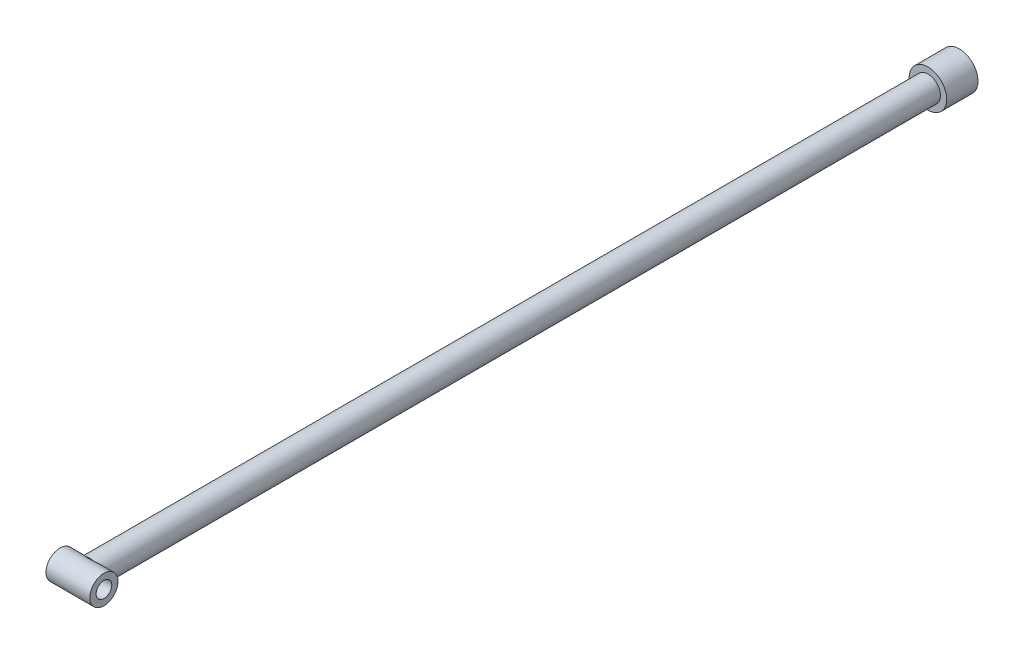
from build123d import *

# Parameters (mm, degrees)
ESQUISSE1_R                  = 29.9
BASE_EXTRUSION_DEPTH         = 50
ESQUISSE2_R                  = 20
BOSS_EXTRU_1_DEPTH           = 1338
ESQUISSE3_R                  = 22.5
ESQUISSE3_R_2                = 12.5
BOSS_EXTRU_2_DEPTH           = 35
ENL_V_MAT_EXTRU_1_REACH      = 1425.245
ENL_V_MAT_EXTRU_1_END_RADIUS = 22.5
ESQUISSE4_R                  = 2.75


with BuildPart() as part:
    # Esquisse1 → Base-Extrusion (new body)
    with BuildSketch(Plane.XY):
        Circle(ESQUISSE1_R)
    extrude(amount=BASE_EXTRUSION_DEPTH)

    # Esquisse2 → Boss.-Extru.1 (add)
    with BuildSketch(Plane.XY.offset(50)):
        Circle(ESQUISSE2_R)
    extrude(amount=BOSS_EXTRU_1_DEPTH)

    # Esquisse3 → Boss.-Extru.2 (add, symmetric)
    with BuildSketch(Plane(origin=(0, 0, 0), x_dir=(0, 0, -1), z_dir=(1, 0, 0))):
        with Locations((-1400, 0)):
            Circle(ESQUISSE3_R)
        with Locations((-1400, 0)):
            Circle(ESQUISSE3_R_2, mode=Mode.SUBTRACT)
    extrude(amount=BOSS_EXTRU_2_DEPTH, both=True)

    # Enl_v. mat.-Extru.1: up to this cylinder (the profile starts inside it)
    enl_v_mat_extru_1_end = Plane(origin=(0, 0, 1400), z_dir=(-1, 0, 0)) * Cylinder(ENL_V_MAT_EXTRU_1_END_RADIUS, 2896.49, mode=Mode.PRIVATE)
    # Esquisse4 → Enl_v. mat.-Extru.1 (cut, up to the surface)
    with BuildSketch(Plane(origin=(0, 0, 0), x_dir=(1, 0, 0), z_dir=(0, 1, 0)), mode=Mode.PRIVATE) as enl_v_mat_extru_1_sk1:
        with Locations(Location((0, -1400, 0), (0, 0, 270))):
            Circle(ESQUISSE4_R)
    enl_v_mat_extru_1_tool1 = extrude(enl_v_mat_extru_1_sk1.sketch, amount=-ENL_V_MAT_EXTRU_1_REACH, mode=Mode.PRIVATE) & enl_v_mat_extru_1_end
    add(enl_v_mat_extru_1_tool1.solids().sort_by_distance((0, 0, 1400))[0], mode=Mode.SUBTRACT)


solid = part.part
